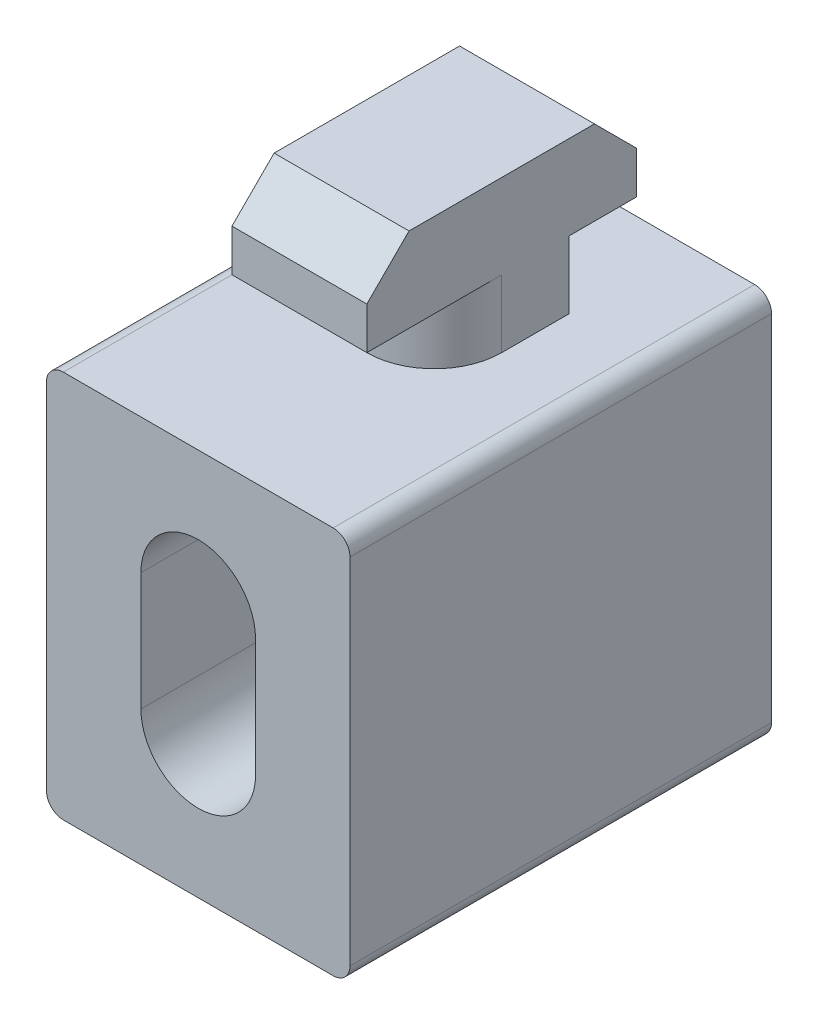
ISO-10303-21;
HEADER;
FILE_DESCRIPTION(('STEP AP214'),'2;1');
FILE_NAME('part.step','',(''),(''),'','','');
FILE_SCHEMA(('AUTOMOTIVE_DESIGN { 1 0 10303 214 1 1 1 1 }'));
ENDSEC;
DATA;
#1=APPLICATION_CONTEXT('core data for automotive mechanical design processes');
#2=APPLICATION_PROTOCOL_DEFINITION('international standard','automotive_design',2000,#1);
#3=PRODUCT_CONTEXT('',#1,'mechanical');
#4=PRODUCT('Part','Part','',(#3));
#5=PRODUCT_RELATED_PRODUCT_CATEGORY('part','',(#4));
#6=PRODUCT_DEFINITION_FORMATION('','',#4);
#7=PRODUCT_DEFINITION_CONTEXT('part definition',#1,'design');
#8=PRODUCT_DEFINITION('design','',#6,#7);
#9=PRODUCT_DEFINITION_SHAPE('','',#8);
#10=(LENGTH_UNIT() NAMED_UNIT(*) SI_UNIT(.MILLI.,.METRE.));
#11=(NAMED_UNIT(*) PLANE_ANGLE_UNIT() SI_UNIT($,.RADIAN.));
#12=(NAMED_UNIT(*) SI_UNIT($,.STERADIAN.) SOLID_ANGLE_UNIT());
#13=UNCERTAINTY_MEASURE_WITH_UNIT(LENGTH_MEASURE(1.E-05),#10,'distance_accuracy_value','');
#14=(GEOMETRIC_REPRESENTATION_CONTEXT(3) GLOBAL_UNCERTAINTY_ASSIGNED_CONTEXT((#13)) GLOBAL_UNIT_ASSIGNED_CONTEXT((#10,
#11,#12)) REPRESENTATION_CONTEXT('',''));
#15=CARTESIAN_POINT('',(0.,0.,0.));
#16=DIRECTION('',(0.,0.,1.));
#17=DIRECTION('',(1.,0.,0.));
#18=AXIS2_PLACEMENT_3D('',#15,#16,#17);
#19=CARTESIAN_POINT('',(-8.99999999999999,11.5,12.5));
#20=DIRECTION('',(0.,-1.,0.));
#21=DIRECTION('',(0.,0.,-1.));
#22=AXIS2_PLACEMENT_3D('',#19,#20,#21);
#23=PLANE('',#22);
#24=DIRECTION('',(-1.,0.,0.));
#25=VECTOR('',#24,1.);
#26=CARTESIAN_POINT('',(-8.99999999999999,11.5,12.5));
#27=LINE('',#26,#25);
#28=CARTESIAN_POINT('',(8.,11.5,12.5));
#29=VERTEX_POINT('',#28);
#30=CARTESIAN_POINT('',(-7.99999999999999,11.5,12.5));
#31=VERTEX_POINT('',#30);
#32=EDGE_CURVE('E565',#29,#31,#27,.T.);
#33=ORIENTED_EDGE('',*,*,#32,.F.);
#34=DIRECTION('',(0.,0.,-1.));
#35=VECTOR('',#34,1.);
#36=CARTESIAN_POINT('',(8.,11.5,12.5));
#37=LINE('',#36,#35);
#38=CARTESIAN_POINT('',(8.,11.5,-12.5));
#39=VERTEX_POINT('',#38);
#40=EDGE_CURVE('E11',#29,#39,#37,.T.);
#41=ORIENTED_EDGE('',*,*,#40,.T.);
#42=DIRECTION('',(-1.,0.,0.));
#43=VECTOR('',#42,1.);
#44=CARTESIAN_POINT('',(-8.99999999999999,11.5,-12.5));
#45=LINE('',#44,#43);
#46=CARTESIAN_POINT('',(-7.99999999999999,11.5,-12.5));
#47=VERTEX_POINT('',#46);
#48=EDGE_CURVE('E425',#39,#47,#45,.T.);
#49=ORIENTED_EDGE('',*,*,#48,.T.);
#50=DIRECTION('',(0.,0.,-1.));
#51=VECTOR('',#50,1.);
#52=CARTESIAN_POINT('',(-7.99999999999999,11.5,12.5));
#53=LINE('',#52,#51);
#54=EDGE_CURVE('E45',#47,#31,#53,.F.);
#55=ORIENTED_EDGE('',*,*,#54,.T.);
#56=EDGE_LOOP('',(#33,#41,#49,#55));
#57=FACE_BOUND('',#56,.T.);
#58=DIRECTION('',(1.,0.,0.));
#59=VECTOR('',#58,1.);
#60=CARTESIAN_POINT('',(-4.,11.5,2.5));
#61=LINE('',#60,#59);
#62=CARTESIAN_POINT('',(-4.,11.5,2.5));
#63=VERTEX_POINT('',#62);
#64=CARTESIAN_POINT('',(0.,11.5,2.5));
#65=VERTEX_POINT('',#64);
#66=EDGE_CURVE('E270',#63,#65,#61,.T.);
#67=ORIENTED_EDGE('',*,*,#66,.F.);
#68=DIRECTION('',(0.,0.,1.));
#69=VECTOR('',#68,1.);
#70=CARTESIAN_POINT('',(-4.,11.5,-1.5));
#71=LINE('',#70,#69);
#72=CARTESIAN_POINT('',(-4.,11.5,-1.5));
#73=VERTEX_POINT('',#72);
#74=EDGE_CURVE('E361',#73,#63,#71,.T.);
#75=ORIENTED_EDGE('',*,*,#74,.F.);
#76=CARTESIAN_POINT('',(0.,11.5,-1.5));
#77=DIRECTION('',(0.,1.,0.));
#78=DIRECTION('',(0.,0.,1.));
#79=AXIS2_PLACEMENT_3D('',#76,#77,#78);
#80=CIRCLE('',#79,4.);
#81=CARTESIAN_POINT('',(0.,11.5,-5.5));
#82=VERTEX_POINT('',#81);
#83=EDGE_CURVE('E468',#82,#73,#80,.T.);
#84=ORIENTED_EDGE('',*,*,#83,.F.);
#85=DIRECTION('',(-1.,0.,0.));
#86=VECTOR('',#85,1.);
#87=CARTESIAN_POINT('',(0.,11.5,-5.5));
#88=LINE('',#87,#86);
#89=CARTESIAN_POINT('',(4.,11.5,-5.5));
#90=VERTEX_POINT('',#89);
#91=EDGE_CURVE('E465',#90,#82,#88,.T.);
#92=ORIENTED_EDGE('',*,*,#91,.F.);
#93=DIRECTION('',(0.,0.,-1.));
#94=VECTOR('',#93,1.);
#95=CARTESIAN_POINT('',(4.,11.5,-5.5));
#96=LINE('',#95,#94);
#97=CARTESIAN_POINT('',(4.,11.5,-1.5));
#98=VERTEX_POINT('',#97);
#99=EDGE_CURVE('E337',#98,#90,#96,.T.);
#100=ORIENTED_EDGE('',*,*,#99,.F.);
#101=CARTESIAN_POINT('',(0.,11.5,-1.5));
#102=DIRECTION('',(0.,1.,0.));
#103=DIRECTION('',(0.,0.,1.));
#104=AXIS2_PLACEMENT_3D('',#101,#102,#103);
#105=CIRCLE('',#104,4.);
#106=EDGE_CURVE('E462',#65,#98,#105,.T.);
#107=ORIENTED_EDGE('',*,*,#106,.F.);
#108=EDGE_LOOP('',(#67,#75,#84,#92,#100,#107));
#109=FACE_BOUND('',#108,.T.);
#110=ADVANCED_FACE('F37',(#57,#109),#23,.F.);
#111=CARTESIAN_POINT('',(3.4,3.5,-12.5));
#112=DIRECTION('',(1.,0.,0.));
#113=DIRECTION('',(0.,1.,0.));
#114=AXIS2_PLACEMENT_3D('',#111,#112,#113);
#115=PLANE('',#114);
#116=DIRECTION('',(0.,0.,1.));
#117=VECTOR('',#116,1.);
#118=CARTESIAN_POINT('',(3.4,-3.5,-12.5));
#119=LINE('',#118,#117);
#120=CARTESIAN_POINT('',(3.4,-3.5,-12.5));
#121=VERTEX_POINT('',#120);
#122=CARTESIAN_POINT('',(3.4,-3.5,-3.5));
#123=VERTEX_POINT('',#122);
#124=EDGE_CURVE('E553',#121,#123,#119,.T.);
#125=ORIENTED_EDGE('',*,*,#124,.T.);
#126=DIRECTION('',(0.,1.,0.));
#127=VECTOR('',#126,1.);
#128=CARTESIAN_POINT('',(3.4,3.5,-3.5));
#129=LINE('',#128,#127);
#130=CARTESIAN_POINT('',(3.4,3.5,-3.5));
#131=VERTEX_POINT('',#130);
#132=EDGE_CURVE('E521',#123,#131,#129,.T.);
#133=ORIENTED_EDGE('',*,*,#132,.T.);
#134=DIRECTION('',(0.,0.,1.));
#135=VECTOR('',#134,1.);
#136=CARTESIAN_POINT('',(3.4,3.5,-12.5));
#137=LINE('',#136,#135);
#138=CARTESIAN_POINT('',(3.4,3.5,-12.5));
#139=VERTEX_POINT('',#138);
#140=EDGE_CURVE('E426',#139,#131,#137,.T.);
#141=ORIENTED_EDGE('',*,*,#140,.F.);
#142=DIRECTION('',(0.,1.,0.));
#143=VECTOR('',#142,1.);
#144=CARTESIAN_POINT('',(3.4,3.5,-12.5));
#145=LINE('',#144,#143);
#146=EDGE_CURVE('E538',#121,#139,#145,.T.);
#147=ORIENTED_EDGE('',*,*,#146,.F.);
#148=EDGE_LOOP('',(#125,#133,#141,#147));
#149=FACE_BOUND('',#148,.T.);
#150=ADVANCED_FACE('F598',(#149),#115,.F.);
#151=CARTESIAN_POINT('',(0.,-3.5,-12.5));
#152=DIRECTION('',(0.,0.,1.));
#153=DIRECTION('',(1.,0.,0.));
#154=AXIS2_PLACEMENT_3D('',#151,#152,#153);
#155=CYLINDRICAL_SURFACE('',#154,3.4);
#156=DIRECTION('',(0.,0.,1.));
#157=VECTOR('',#156,1.);
#158=CARTESIAN_POINT('',(-3.4,-3.5,-12.5));
#159=LINE('',#158,#157);
#160=CARTESIAN_POINT('',(-3.4,-3.5,-12.5));
#161=VERTEX_POINT('',#160);
#162=CARTESIAN_POINT('',(-3.4,-3.5,-3.5));
#163=VERTEX_POINT('',#162);
#164=EDGE_CURVE('E557',#161,#163,#159,.T.);
#165=ORIENTED_EDGE('',*,*,#164,.T.);
#166=CARTESIAN_POINT('',(0.,-3.5,-3.5));
#167=DIRECTION('',(0.,0.,-1.));
#168=DIRECTION('',(-1.,0.,0.));
#169=AXIS2_PLACEMENT_3D('',#166,#167,#168);
#170=CIRCLE('',#169,3.4);
#171=EDGE_CURVE('E518',#163,#123,#170,.F.);
#172=ORIENTED_EDGE('',*,*,#171,.T.);
#173=ORIENTED_EDGE('',*,*,#124,.F.);
#174=CARTESIAN_POINT('',(0.,-3.5,-12.5));
#175=DIRECTION('',(0.,0.,1.));
#176=DIRECTION('',(1.,0.,0.));
#177=AXIS2_PLACEMENT_3D('',#174,#175,#176);
#178=CIRCLE('',#177,3.4);
#179=EDGE_CURVE('E535',#161,#121,#178,.T.);
#180=ORIENTED_EDGE('',*,*,#179,.F.);
#181=EDGE_LOOP('',(#165,#172,#173,#180));
#182=FACE_BOUND('',#181,.T.);
#183=ADVANCED_FACE('F603',(#182),#155,.F.);
#184=CARTESIAN_POINT('',(-3.4,3.5,-12.5));
#185=DIRECTION('',(-1.,0.,0.));
#186=DIRECTION('',(0.,-1.,0.));
#187=AXIS2_PLACEMENT_3D('',#184,#185,#186);
#188=PLANE('',#187);
#189=DIRECTION('',(0.,0.,1.));
#190=VECTOR('',#189,1.);
#191=CARTESIAN_POINT('',(-3.4,3.5,-12.5));
#192=LINE('',#191,#190);
#193=CARTESIAN_POINT('',(-3.4,3.5,-12.5));
#194=VERTEX_POINT('',#193);
#195=CARTESIAN_POINT('',(-3.4,3.5,-3.5));
#196=VERTEX_POINT('',#195);
#197=EDGE_CURVE('E561',#194,#196,#192,.T.);
#198=ORIENTED_EDGE('',*,*,#197,.T.);
#199=DIRECTION('',(0.,-1.,0.));
#200=VECTOR('',#199,1.);
#201=CARTESIAN_POINT('',(-3.4,3.5,-3.5));
#202=LINE('',#201,#200);
#203=EDGE_CURVE('E444',#196,#163,#202,.T.);
#204=ORIENTED_EDGE('',*,*,#203,.T.);
#205=ORIENTED_EDGE('',*,*,#164,.F.);
#206=DIRECTION('',(0.,-1.,0.));
#207=VECTOR('',#206,1.);
#208=CARTESIAN_POINT('',(-3.4,3.5,-12.5));
#209=LINE('',#208,#207);
#210=EDGE_CURVE('E531',#194,#161,#209,.T.);
#211=ORIENTED_EDGE('',*,*,#210,.F.);
#212=EDGE_LOOP('',(#198,#204,#205,#211));
#213=FACE_BOUND('',#212,.T.);
#214=ADVANCED_FACE('F613',(#213),#188,.F.);
#215=CARTESIAN_POINT('',(9.00000000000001,11.5,12.5));
#216=DIRECTION('',(-1.,0.,0.));
#217=DIRECTION('',(0.,-1.,0.));
#218=AXIS2_PLACEMENT_3D('',#215,#216,#217);
#219=PLANE('',#218);
#220=DIRECTION('',(0.,1.,0.));
#221=VECTOR('',#220,1.);
#222=CARTESIAN_POINT('',(9.00000000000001,11.5,12.5));
#223=LINE('',#222,#221);
#224=CARTESIAN_POINT('',(9.00000000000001,-10.5,12.5));
#225=VERTEX_POINT('',#224);
#226=CARTESIAN_POINT('',(9.00000000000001,10.5,12.5));
#227=VERTEX_POINT('',#226);
#228=EDGE_CURVE('E417',#225,#227,#223,.T.);
#229=ORIENTED_EDGE('',*,*,#228,.F.);
#230=DIRECTION('',(0.,0.,-1.));
#231=VECTOR('',#230,1.);
#232=CARTESIAN_POINT('',(9.00000000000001,-10.5,12.5));
#233=LINE('',#232,#231);
#234=CARTESIAN_POINT('',(9.00000000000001,-10.5,-12.5));
#235=VERTEX_POINT('',#234);
#236=EDGE_CURVE('E407',#225,#235,#233,.T.);
#237=ORIENTED_EDGE('',*,*,#236,.T.);
#238=DIRECTION('',(0.,1.,0.));
#239=VECTOR('',#238,1.);
#240=CARTESIAN_POINT('',(9.00000000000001,11.5,-12.5));
#241=LINE('',#240,#239);
#242=CARTESIAN_POINT('',(9.00000000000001,10.5,-12.5));
#243=VERTEX_POINT('',#242);
#244=EDGE_CURVE('E415',#235,#243,#241,.T.);
#245=ORIENTED_EDGE('',*,*,#244,.T.);
#246=DIRECTION('',(0.,0.,-1.));
#247=VECTOR('',#246,1.);
#248=CARTESIAN_POINT('',(9.00000000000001,10.5,12.5));
#249=LINE('',#248,#247);
#250=EDGE_CURVE('E405',#243,#227,#249,.F.);
#251=ORIENTED_EDGE('',*,*,#250,.T.);
#252=EDGE_LOOP('',(#229,#237,#245,#251));
#253=FACE_BOUND('',#252,.T.);
#254=ADVANCED_FACE('F414',(#253),#219,.F.);
#255=CARTESIAN_POINT('',(-8.99999999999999,11.5,12.5));
#256=DIRECTION('',(1.,0.,0.));
#257=DIRECTION('',(0.,1.,0.));
#258=AXIS2_PLACEMENT_3D('',#255,#256,#257);
#259=PLANE('',#258);
#260=DIRECTION('',(0.,-1.,0.));
#261=VECTOR('',#260,1.);
#262=CARTESIAN_POINT('',(-8.99999999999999,11.5,-12.5));
#263=LINE('',#262,#261);
#264=CARTESIAN_POINT('',(-8.99999999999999,10.5,-12.5));
#265=VERTEX_POINT('',#264);
#266=CARTESIAN_POINT('',(-8.99999999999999,-10.5,-12.5));
#267=VERTEX_POINT('',#266);
#268=EDGE_CURVE('E428',#265,#267,#263,.T.);
#269=ORIENTED_EDGE('',*,*,#268,.T.);
#270=DIRECTION('',(0.,0.,-1.));
#271=VECTOR('',#270,1.);
#272=CARTESIAN_POINT('',(-8.99999999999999,-10.5,12.5));
#273=LINE('',#272,#271);
#274=CARTESIAN_POINT('',(-8.99999999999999,-10.5,12.5));
#275=VERTEX_POINT('',#274);
#276=EDGE_CURVE('E396',#267,#275,#273,.F.);
#277=ORIENTED_EDGE('',*,*,#276,.T.);
#278=DIRECTION('',(0.,-1.,0.));
#279=VECTOR('',#278,1.);
#280=CARTESIAN_POINT('',(-8.99999999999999,11.5,12.5));
#281=LINE('',#280,#279);
#282=CARTESIAN_POINT('',(-8.99999999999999,10.5,12.5));
#283=VERTEX_POINT('',#282);
#284=EDGE_CURVE('E566',#283,#275,#281,.T.);
#285=ORIENTED_EDGE('',*,*,#284,.F.);
#286=DIRECTION('',(0.,0.,-1.));
#287=VECTOR('',#286,1.);
#288=CARTESIAN_POINT('',(-8.99999999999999,10.5,12.5));
#289=LINE('',#288,#287);
#290=EDGE_CURVE('E393',#283,#265,#289,.T.);
#291=ORIENTED_EDGE('',*,*,#290,.T.);
#292=EDGE_LOOP('',(#269,#277,#285,#291));
#293=FACE_BOUND('',#292,.T.);
#294=ADVANCED_FACE('F582',(#293),#259,.F.);
#295=CARTESIAN_POINT('',(-8.99999999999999,-11.5,12.5));
#296=DIRECTION('',(0.,1.,0.));
#297=DIRECTION('',(0.,0.,1.));
#298=AXIS2_PLACEMENT_3D('',#295,#296,#297);
#299=PLANE('',#298);
#300=DIRECTION('',(-1.,0.,0.));
#301=VECTOR('',#300,1.);
#302=CARTESIAN_POINT('',(-5.,-11.5,1.5));
#303=LINE('',#302,#301);
#304=CARTESIAN_POINT('',(5.,-11.5,1.5));
#305=VERTEX_POINT('',#304);
#306=CARTESIAN_POINT('',(-5.,-11.5,1.5));
#307=VERTEX_POINT('',#306);
#308=EDGE_CURVE('E492',#305,#307,#303,.T.);
#309=ORIENTED_EDGE('',*,*,#308,.F.);
#310=DIRECTION('',(0.,0.,1.));
#311=VECTOR('',#310,1.);
#312=CARTESIAN_POINT('',(5.,-11.5,1.5));
#313=LINE('',#312,#311);
#314=CARTESIAN_POINT('',(5.,-11.5,-3.5));
#315=VERTEX_POINT('',#314);
#316=EDGE_CURVE('E343',#315,#305,#313,.T.);
#317=ORIENTED_EDGE('',*,*,#316,.F.);
#318=DIRECTION('',(1.,0.,0.));
#319=VECTOR('',#318,1.);
#320=CARTESIAN_POINT('',(-5.,-11.5,-3.5));
#321=LINE('',#320,#319);
#322=CARTESIAN_POINT('',(-5.,-11.5,-3.5));
#323=VERTEX_POINT('',#322);
#324=EDGE_CURVE('E479',#323,#315,#321,.T.);
#325=ORIENTED_EDGE('',*,*,#324,.F.);
#326=DIRECTION('',(0.,0.,-1.));
#327=VECTOR('',#326,1.);
#328=CARTESIAN_POINT('',(-5.,-11.5,1.5));
#329=LINE('',#328,#327);
#330=EDGE_CURVE('E495',#307,#323,#329,.T.);
#331=ORIENTED_EDGE('',*,*,#330,.F.);
#332=EDGE_LOOP('',(#309,#317,#325,#331));
#333=FACE_BOUND('',#332,.T.);
#334=DIRECTION('',(1.,0.,0.));
#335=VECTOR('',#334,1.);
#336=CARTESIAN_POINT('',(-8.99999999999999,-11.5,12.5));
#337=LINE('',#336,#335);
#338=CARTESIAN_POINT('',(-7.99999999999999,-11.5,12.5));
#339=VERTEX_POINT('',#338);
#340=CARTESIAN_POINT('',(8.00000000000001,-11.5,12.5));
#341=VERTEX_POINT('',#340);
#342=EDGE_CURVE('E434',#339,#341,#337,.T.);
#343=ORIENTED_EDGE('',*,*,#342,.F.);
#344=DIRECTION('',(0.,0.,-1.));
#345=VECTOR('',#344,1.);
#346=CARTESIAN_POINT('',(-7.99999999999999,-11.5,12.5));
#347=LINE('',#346,#345);
#348=CARTESIAN_POINT('',(-7.99999999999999,-11.5,-12.5));
#349=VERTEX_POINT('',#348);
#350=EDGE_CURVE('E382',#339,#349,#347,.T.);
#351=ORIENTED_EDGE('',*,*,#350,.T.);
#352=DIRECTION('',(1.,0.,0.));
#353=VECTOR('',#352,1.);
#354=CARTESIAN_POINT('',(-8.99999999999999,-11.5,-12.5));
#355=LINE('',#354,#353);
#356=CARTESIAN_POINT('',(8.00000000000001,-11.5,-12.5));
#357=VERTEX_POINT('',#356);
#358=EDGE_CURVE('E439',#349,#357,#355,.T.);
#359=ORIENTED_EDGE('',*,*,#358,.T.);
#360=DIRECTION('',(0.,0.,-1.));
#361=VECTOR('',#360,1.);
#362=CARTESIAN_POINT('',(8.00000000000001,-11.5,12.5));
#363=LINE('',#362,#361);
#364=EDGE_CURVE('E380',#357,#341,#363,.F.);
#365=ORIENTED_EDGE('',*,*,#364,.T.);
#366=EDGE_LOOP('',(#343,#351,#359,#365));
#367=FACE_BOUND('',#366,.T.);
#368=ADVANCED_FACE('F577',(#333,#367),#299,.F.);
#369=CARTESIAN_POINT('',(0.,0.,12.5));
#370=DIRECTION('',(0.,0.,1.));
#371=DIRECTION('',(1.,0.,0.));
#372=AXIS2_PLACEMENT_3D('',#369,#370,#371);
#373=PLANE('',#372);
#374=CARTESIAN_POINT('',(0.,3.5,12.5));
#375=DIRECTION('',(0.,0.,1.));
#376=DIRECTION('',(1.,0.,0.));
#377=AXIS2_PLACEMENT_3D('',#374,#375,#376);
#378=CIRCLE('',#377,3.4);
#379=CARTESIAN_POINT('',(3.4,3.5,12.5));
#380=VERTEX_POINT('',#379);
#381=CARTESIAN_POINT('',(-3.4,3.5,12.5));
#382=VERTEX_POINT('',#381);
#383=EDGE_CURVE('E542',#380,#382,#378,.T.);
#384=ORIENTED_EDGE('',*,*,#383,.F.);
#385=DIRECTION('',(0.,1.,0.));
#386=VECTOR('',#385,1.);
#387=CARTESIAN_POINT('',(3.4,3.5,12.5));
#388=LINE('',#387,#386);
#389=CARTESIAN_POINT('',(3.4,-3.5,12.5));
#390=VERTEX_POINT('',#389);
#391=EDGE_CURVE('E532',#390,#380,#388,.T.);
#392=ORIENTED_EDGE('',*,*,#391,.F.);
#393=CARTESIAN_POINT('',(0.,-3.5,12.5));
#394=DIRECTION('',(0.,0.,1.));
#395=DIRECTION('',(1.,0.,0.));
#396=AXIS2_PLACEMENT_3D('',#393,#394,#395);
#397=CIRCLE('',#396,3.4);
#398=CARTESIAN_POINT('',(-3.4,-3.5,12.5));
#399=VERTEX_POINT('',#398);
#400=EDGE_CURVE('E548',#399,#390,#397,.T.);
#401=ORIENTED_EDGE('',*,*,#400,.F.);
#402=DIRECTION('',(0.,-1.,0.));
#403=VECTOR('',#402,1.);
#404=CARTESIAN_POINT('',(-3.4,3.5,12.5));
#405=LINE('',#404,#403);
#406=EDGE_CURVE('E545',#382,#399,#405,.T.);
#407=ORIENTED_EDGE('',*,*,#406,.F.);
#408=EDGE_LOOP('',(#384,#392,#401,#407));
#409=FACE_BOUND('',#408,.T.);
#410=ORIENTED_EDGE('',*,*,#284,.T.);
#411=CARTESIAN_POINT('',(-7.99999999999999,-10.5,12.5));
#412=DIRECTION('',(0.,0.,1.));
#413=DIRECTION('',(1.,0.,0.));
#414=AXIS2_PLACEMENT_3D('',#411,#412,#413);
#415=CIRCLE('',#414,1.);
#416=EDGE_CURVE('E403',#275,#339,#415,.T.);
#417=ORIENTED_EDGE('',*,*,#416,.T.);
#418=ORIENTED_EDGE('',*,*,#342,.T.);
#419=CARTESIAN_POINT('',(8.00000000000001,-10.5,12.5));
#420=DIRECTION('',(0.,0.,1.));
#421=DIRECTION('',(1.,0.,0.));
#422=AXIS2_PLACEMENT_3D('',#419,#420,#421);
#423=CIRCLE('',#422,1.);
#424=EDGE_CURVE('E401',#341,#225,#423,.T.);
#425=ORIENTED_EDGE('',*,*,#424,.T.);
#426=ORIENTED_EDGE('',*,*,#228,.T.);
#427=CARTESIAN_POINT('',(8.,10.5,12.5));
#428=DIRECTION('',(0.,0.,1.));
#429=DIRECTION('',(1.,0.,0.));
#430=AXIS2_PLACEMENT_3D('',#427,#428,#429);
#431=CIRCLE('',#430,1.);
#432=EDGE_CURVE('E58',#227,#29,#431,.T.);
#433=ORIENTED_EDGE('',*,*,#432,.T.);
#434=ORIENTED_EDGE('',*,*,#32,.T.);
#435=CARTESIAN_POINT('',(-7.99999999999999,10.5,12.5));
#436=DIRECTION('',(0.,0.,1.));
#437=DIRECTION('',(1.,0.,0.));
#438=AXIS2_PLACEMENT_3D('',#435,#436,#437);
#439=CIRCLE('',#438,1.);
#440=EDGE_CURVE('E398',#31,#283,#439,.T.);
#441=ORIENTED_EDGE('',*,*,#440,.T.);
#442=EDGE_LOOP('',(#410,#417,#418,#425,#426,#433,#434,#441));
#443=FACE_BOUND('',#442,.T.);
#444=ADVANCED_FACE('F572',(#409,#443),#373,.T.);
#445=CARTESIAN_POINT('',(0.,0.,-12.5));
#446=DIRECTION('',(0.,0.,1.));
#447=DIRECTION('',(1.,0.,0.));
#448=AXIS2_PLACEMENT_3D('',#445,#446,#447);
#449=PLANE('',#448);
#450=ORIENTED_EDGE('',*,*,#146,.T.);
#451=CARTESIAN_POINT('',(0.,3.5,-12.5));
#452=DIRECTION('',(0.,0.,1.));
#453=DIRECTION('',(1.,0.,0.));
#454=AXIS2_PLACEMENT_3D('',#451,#452,#453);
#455=CIRCLE('',#454,3.4);
#456=EDGE_CURVE('E528',#139,#194,#455,.T.);
#457=ORIENTED_EDGE('',*,*,#456,.T.);
#458=ORIENTED_EDGE('',*,*,#210,.T.);
#459=ORIENTED_EDGE('',*,*,#179,.T.);
#460=EDGE_LOOP('',(#450,#457,#458,#459));
#461=FACE_BOUND('',#460,.T.);
#462=ORIENTED_EDGE('',*,*,#358,.F.);
#463=CARTESIAN_POINT('',(-7.99999999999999,-10.5,-12.5));
#464=DIRECTION('',(0.,0.,1.));
#465=DIRECTION('',(1.,0.,0.));
#466=AXIS2_PLACEMENT_3D('',#463,#464,#465);
#467=CIRCLE('',#466,1.);
#468=EDGE_CURVE('E391',#349,#267,#467,.F.);
#469=ORIENTED_EDGE('',*,*,#468,.T.);
#470=ORIENTED_EDGE('',*,*,#268,.F.);
#471=CARTESIAN_POINT('',(-7.99999999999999,10.5,-12.5));
#472=DIRECTION('',(0.,0.,1.));
#473=DIRECTION('',(1.,0.,0.));
#474=AXIS2_PLACEMENT_3D('',#471,#472,#473);
#475=CIRCLE('',#474,1.);
#476=EDGE_CURVE('E385',#265,#47,#475,.F.);
#477=ORIENTED_EDGE('',*,*,#476,.T.);
#478=ORIENTED_EDGE('',*,*,#48,.F.);
#479=CARTESIAN_POINT('',(8.,10.5,-12.5));
#480=DIRECTION('',(0.,0.,1.));
#481=DIRECTION('',(1.,0.,0.));
#482=AXIS2_PLACEMENT_3D('',#479,#480,#481);
#483=CIRCLE('',#482,1.);
#484=EDGE_CURVE('E387',#39,#243,#483,.F.);
#485=ORIENTED_EDGE('',*,*,#484,.T.);
#486=ORIENTED_EDGE('',*,*,#244,.F.);
#487=CARTESIAN_POINT('',(8.00000000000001,-10.5,-12.5));
#488=DIRECTION('',(0.,0.,1.));
#489=DIRECTION('',(1.,0.,0.));
#490=AXIS2_PLACEMENT_3D('',#487,#488,#489);
#491=CIRCLE('',#490,1.);
#492=EDGE_CURVE('E389',#235,#357,#491,.F.);
#493=ORIENTED_EDGE('',*,*,#492,.T.);
#494=EDGE_LOOP('',(#462,#469,#470,#477,#478,#485,#486,#493));
#495=FACE_BOUND('',#494,.T.);
#496=ADVANCED_FACE('F422',(#461,#495),#449,.F.);
#497=CARTESIAN_POINT('',(0.,3.5,-12.5));
#498=DIRECTION('',(0.,0.,1.));
#499=DIRECTION('',(1.,0.,0.));
#500=AXIS2_PLACEMENT_3D('',#497,#498,#499);
#501=CYLINDRICAL_SURFACE('',#500,3.4);
#502=ORIENTED_EDGE('',*,*,#140,.T.);
#503=CARTESIAN_POINT('',(0.,3.5,-3.5));
#504=DIRECTION('',(0.,0.,-1.));
#505=DIRECTION('',(-1.,0.,0.));
#506=AXIS2_PLACEMENT_3D('',#503,#504,#505);
#507=CIRCLE('',#506,3.4);
#508=CARTESIAN_POINT('',(1.59999999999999,6.5,-3.5));
#509=VERTEX_POINT('',#508);
#510=EDGE_CURVE('E524',#131,#509,#507,.F.);
#511=ORIENTED_EDGE('',*,*,#510,.T.);
#512=DIRECTION('',(0.,0.,1.));
#513=VECTOR('',#512,1.);
#514=CARTESIAN_POINT('',(1.59999999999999,6.5,-12.5));
#515=LINE('',#514,#513);
#516=CARTESIAN_POINT('',(1.59999999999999,6.5,1.5));
#517=VERTEX_POINT('',#516);
#518=EDGE_CURVE('E367',#517,#509,#515,.F.);
#519=ORIENTED_EDGE('',*,*,#518,.F.);
#520=CARTESIAN_POINT('',(0.,3.5,1.5));
#521=DIRECTION('',(0.,0.,1.));
#522=DIRECTION('',(1.,0.,0.));
#523=AXIS2_PLACEMENT_3D('',#520,#521,#522);
#524=CIRCLE('',#523,3.4);
#525=CARTESIAN_POINT('',(3.4,3.5,1.5));
#526=VERTEX_POINT('',#525);
#527=EDGE_CURVE('E517',#517,#526,#524,.F.);
#528=ORIENTED_EDGE('',*,*,#527,.T.);
#529=EDGE_CURVE('E431',#526,#380,#137,.T.);
#530=ORIENTED_EDGE('',*,*,#529,.T.);
#531=ORIENTED_EDGE('',*,*,#383,.T.);
#532=CARTESIAN_POINT('',(-3.4,3.5,1.5));
#533=VERTEX_POINT('',#532);
#534=EDGE_CURVE('E541',#533,#382,#192,.T.);
#535=ORIENTED_EDGE('',*,*,#534,.F.);
#536=CARTESIAN_POINT('',(-1.59999999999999,6.5,1.5));
#537=VERTEX_POINT('',#536);
#538=EDGE_CURVE('E514',#533,#537,#524,.F.);
#539=ORIENTED_EDGE('',*,*,#538,.T.);
#540=DIRECTION('',(0.,0.,1.));
#541=VECTOR('',#540,1.);
#542=CARTESIAN_POINT('',(-1.59999999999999,6.5,-12.5));
#543=LINE('',#542,#541);
#544=CARTESIAN_POINT('',(-1.59999999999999,6.5,-3.5));
#545=VERTEX_POINT('',#544);
#546=EDGE_CURVE('E447',#545,#537,#543,.T.);
#547=ORIENTED_EDGE('',*,*,#546,.F.);
#548=EDGE_CURVE('E527',#545,#196,#507,.F.);
#549=ORIENTED_EDGE('',*,*,#548,.T.);
#550=ORIENTED_EDGE('',*,*,#197,.F.);
#551=ORIENTED_EDGE('',*,*,#456,.F.);
#552=EDGE_LOOP('',(#502,#511,#519,#528,#530,#531,#535,#539,#547,#549,#550,#551));
#553=FACE_BOUND('',#552,.T.);
#554=ADVANCED_FACE('F677',(#553),#501,.F.);
#555=ORIENTED_EDGE('',*,*,#529,.F.);
#556=DIRECTION('',(0.,-1.,0.));
#557=VECTOR('',#556,1.);
#558=CARTESIAN_POINT('',(3.4,3.5,1.5));
#559=LINE('',#558,#557);
#560=CARTESIAN_POINT('',(3.4,-3.5,1.5));
#561=VERTEX_POINT('',#560);
#562=EDGE_CURVE('E511',#526,#561,#559,.T.);
#563=ORIENTED_EDGE('',*,*,#562,.T.);
#564=EDGE_CURVE('E556',#561,#390,#119,.T.);
#565=ORIENTED_EDGE('',*,*,#564,.T.);
#566=ORIENTED_EDGE('',*,*,#391,.T.);
#567=EDGE_LOOP('',(#555,#563,#565,#566));
#568=FACE_BOUND('',#567,.T.);
#569=ADVANCED_FACE('F606',(#568),#115,.F.);
#570=ORIENTED_EDGE('',*,*,#564,.F.);
#571=CARTESIAN_POINT('',(0.,-3.5,1.5));
#572=DIRECTION('',(0.,0.,1.));
#573=DIRECTION('',(1.,0.,0.));
#574=AXIS2_PLACEMENT_3D('',#571,#572,#573);
#575=CIRCLE('',#574,3.4);
#576=CARTESIAN_POINT('',(-3.4,-3.5,1.5));
#577=VERTEX_POINT('',#576);
#578=EDGE_CURVE('E502',#561,#577,#575,.F.);
#579=ORIENTED_EDGE('',*,*,#578,.T.);
#580=EDGE_CURVE('E560',#577,#399,#159,.T.);
#581=ORIENTED_EDGE('',*,*,#580,.T.);
#582=ORIENTED_EDGE('',*,*,#400,.T.);
#583=EDGE_LOOP('',(#570,#579,#581,#582));
#584=FACE_BOUND('',#583,.T.);
#585=ADVANCED_FACE('F676',(#584),#155,.F.);
#586=ORIENTED_EDGE('',*,*,#580,.F.);
#587=DIRECTION('',(0.,1.,0.));
#588=VECTOR('',#587,1.);
#589=CARTESIAN_POINT('',(-3.4,3.5,1.5));
#590=LINE('',#589,#588);
#591=EDGE_CURVE('E441',#577,#533,#590,.T.);
#592=ORIENTED_EDGE('',*,*,#591,.T.);
#593=ORIENTED_EDGE('',*,*,#534,.T.);
#594=ORIENTED_EDGE('',*,*,#406,.T.);
#595=EDGE_LOOP('',(#586,#592,#593,#594));
#596=FACE_BOUND('',#595,.T.);
#597=ADVANCED_FACE('F658',(#596),#188,.F.);
#598=CARTESIAN_POINT('',(0.,6.5,0.));
#599=DIRECTION('',(0.,-1.,0.));
#600=DIRECTION('',(0.,0.,-1.));
#601=AXIS2_PLACEMENT_3D('',#598,#599,#600);
#602=PLANE('',#601);
#603=ORIENTED_EDGE('',*,*,#518,.T.);
#604=DIRECTION('',(1.,0.,0.));
#605=VECTOR('',#604,1.);
#606=CARTESIAN_POINT('',(-5.,6.5,-3.5));
#607=LINE('',#606,#605);
#608=CARTESIAN_POINT('',(5.,6.5,-3.5));
#609=VERTEX_POINT('',#608);
#610=EDGE_CURVE('E486',#509,#609,#607,.T.);
#611=ORIENTED_EDGE('',*,*,#610,.T.);
#612=DIRECTION('',(0.,0.,1.));
#613=VECTOR('',#612,1.);
#614=CARTESIAN_POINT('',(5.,6.5,1.5));
#615=LINE('',#614,#613);
#616=CARTESIAN_POINT('',(5.,6.5,1.5));
#617=VERTEX_POINT('',#616);
#618=EDGE_CURVE('E475',#609,#617,#615,.T.);
#619=ORIENTED_EDGE('',*,*,#618,.T.);
#620=DIRECTION('',(-1.,0.,0.));
#621=VECTOR('',#620,1.);
#622=CARTESIAN_POINT('',(-5.,6.5,1.5));
#623=LINE('',#622,#621);
#624=EDGE_CURVE('E480',#617,#517,#623,.T.);
#625=ORIENTED_EDGE('',*,*,#624,.T.);
#626=EDGE_LOOP('',(#603,#611,#619,#625));
#627=FACE_BOUND('',#626,.T.);
#628=ADVANCED_FACE('F654',(#627),#602,.T.);
#629=ORIENTED_EDGE('',*,*,#546,.T.);
#630=CARTESIAN_POINT('',(-5.,6.5,1.5));
#631=VERTEX_POINT('',#630);
#632=EDGE_CURVE('E478',#537,#631,#623,.T.);
#633=ORIENTED_EDGE('',*,*,#632,.T.);
#634=DIRECTION('',(0.,0.,-1.));
#635=VECTOR('',#634,1.);
#636=CARTESIAN_POINT('',(-5.,6.5,1.5));
#637=LINE('',#636,#635);
#638=CARTESIAN_POINT('',(-5.,6.5,-3.5));
#639=VERTEX_POINT('',#638);
#640=EDGE_CURVE('E483',#631,#639,#637,.T.);
#641=ORIENTED_EDGE('',*,*,#640,.T.);
#642=EDGE_CURVE('E487',#639,#545,#607,.T.);
#643=ORIENTED_EDGE('',*,*,#642,.T.);
#644=EDGE_LOOP('',(#629,#633,#641,#643));
#645=FACE_BOUND('',#644,.T.);
#646=ADVANCED_FACE('F657',(#645),#602,.T.);
#647=CARTESIAN_POINT('',(-5.,6.5,-3.5));
#648=DIRECTION('',(0.,0.,-1.));
#649=DIRECTION('',(-1.,0.,0.));
#650=AXIS2_PLACEMENT_3D('',#647,#648,#649);
#651=PLANE('',#650);
#652=ORIENTED_EDGE('',*,*,#642,.F.);
#653=DIRECTION('',(0.,-1.,0.));
#654=VECTOR('',#653,1.);
#655=CARTESIAN_POINT('',(-5.,6.5,-3.5));
#656=LINE('',#655,#654);
#657=EDGE_CURVE('E503',#639,#323,#656,.T.);
#658=ORIENTED_EDGE('',*,*,#657,.T.);
#659=ORIENTED_EDGE('',*,*,#324,.T.);
#660=DIRECTION('',(0.,-1.,0.));
#661=VECTOR('',#660,1.);
#662=CARTESIAN_POINT('',(5.,6.5,-3.5));
#663=LINE('',#662,#661);
#664=EDGE_CURVE('E500',#609,#315,#663,.T.);
#665=ORIENTED_EDGE('',*,*,#664,.F.);
#666=ORIENTED_EDGE('',*,*,#610,.F.);
#667=ORIENTED_EDGE('',*,*,#510,.F.);
#668=ORIENTED_EDGE('',*,*,#132,.F.);
#669=ORIENTED_EDGE('',*,*,#171,.F.);
#670=ORIENTED_EDGE('',*,*,#203,.F.);
#671=ORIENTED_EDGE('',*,*,#548,.F.);
#672=EDGE_LOOP('',(#652,#658,#659,#665,#666,#667,#668,#669,#670,#671));
#673=FACE_BOUND('',#672,.T.);
#674=ADVANCED_FACE('F660',(#673),#651,.F.);
#675=CARTESIAN_POINT('',(-5.,6.5,1.5));
#676=DIRECTION('',(0.,0.,1.));
#677=DIRECTION('',(1.,0.,0.));
#678=AXIS2_PLACEMENT_3D('',#675,#676,#677);
#679=PLANE('',#678);
#680=ORIENTED_EDGE('',*,*,#624,.F.);
#681=DIRECTION('',(0.,-1.,0.));
#682=VECTOR('',#681,1.);
#683=CARTESIAN_POINT('',(5.,6.5,1.5));
#684=LINE('',#683,#682);
#685=EDGE_CURVE('E490',#617,#305,#684,.T.);
#686=ORIENTED_EDGE('',*,*,#685,.T.);
#687=ORIENTED_EDGE('',*,*,#308,.T.);
#688=DIRECTION('',(0.,-1.,0.));
#689=VECTOR('',#688,1.);
#690=CARTESIAN_POINT('',(-5.,6.5,1.5));
#691=LINE('',#690,#689);
#692=EDGE_CURVE('E505',#631,#307,#691,.T.);
#693=ORIENTED_EDGE('',*,*,#692,.F.);
#694=ORIENTED_EDGE('',*,*,#632,.F.);
#695=ORIENTED_EDGE('',*,*,#538,.F.);
#696=ORIENTED_EDGE('',*,*,#591,.F.);
#697=ORIENTED_EDGE('',*,*,#578,.F.);
#698=ORIENTED_EDGE('',*,*,#562,.F.);
#699=ORIENTED_EDGE('',*,*,#527,.F.);
#700=EDGE_LOOP('',(#680,#686,#687,#693,#694,#695,#696,#697,#698,#699));
#701=FACE_BOUND('',#700,.T.);
#702=ADVANCED_FACE('F663',(#701),#679,.F.);
#703=CARTESIAN_POINT('',(5.,6.5,1.5));
#704=DIRECTION('',(1.,0.,0.));
#705=DIRECTION('',(0.,0.,-1.));
#706=AXIS2_PLACEMENT_3D('',#703,#704,#705);
#707=PLANE('',#706);
#708=ORIENTED_EDGE('',*,*,#316,.T.);
#709=ORIENTED_EDGE('',*,*,#685,.F.);
#710=ORIENTED_EDGE('',*,*,#618,.F.);
#711=ORIENTED_EDGE('',*,*,#664,.T.);
#712=EDGE_LOOP('',(#708,#709,#710,#711));
#713=FACE_BOUND('',#712,.T.);
#714=ADVANCED_FACE('F667',(#713),#707,.F.);
#715=CARTESIAN_POINT('',(-5.,6.5,1.5));
#716=DIRECTION('',(-1.,0.,0.));
#717=DIRECTION('',(0.,0.,1.));
#718=AXIS2_PLACEMENT_3D('',#715,#716,#717);
#719=PLANE('',#718);
#720=ORIENTED_EDGE('',*,*,#330,.T.);
#721=ORIENTED_EDGE('',*,*,#657,.F.);
#722=ORIENTED_EDGE('',*,*,#640,.F.);
#723=ORIENTED_EDGE('',*,*,#692,.T.);
#724=EDGE_LOOP('',(#720,#721,#722,#723));
#725=FACE_BOUND('',#724,.T.);
#726=ADVANCED_FACE('F653',(#725),#719,.F.);
#727=CARTESIAN_POINT('',(-4.,15.5,2.5));
#728=DIRECTION('',(0.,0.,-1.));
#729=DIRECTION('',(-1.,0.,0.));
#730=AXIS2_PLACEMENT_3D('',#727,#728,#729);
#731=PLANE('',#730);
#732=ORIENTED_EDGE('',*,*,#66,.T.);
#733=DIRECTION('',(0.,-1.,0.));
#734=VECTOR('',#733,1.);
#735=CARTESIAN_POINT('',(0.,15.5,2.5));
#736=LINE('',#735,#734);
#737=CARTESIAN_POINT('',(0.,15.5,2.5));
#738=VERTEX_POINT('',#737);
#739=EDGE_CURVE('E340',#738,#65,#736,.T.);
#740=ORIENTED_EDGE('',*,*,#739,.F.);
#741=DIRECTION('',(1.,0.,0.));
#742=VECTOR('',#741,1.);
#743=CARTESIAN_POINT('',(-4.,15.5,2.5));
#744=LINE('',#743,#742);
#745=CARTESIAN_POINT('',(-4.,15.5,2.5));
#746=VERTEX_POINT('',#745);
#747=EDGE_CURVE('E359',#746,#738,#744,.T.);
#748=ORIENTED_EDGE('',*,*,#747,.F.);
#749=DIRECTION('',(0.,-1.,0.));
#750=VECTOR('',#749,1.);
#751=CARTESIAN_POINT('',(-4.,15.5,2.5));
#752=LINE('',#751,#750);
#753=EDGE_CURVE('E352',#746,#63,#752,.T.);
#754=ORIENTED_EDGE('',*,*,#753,.T.);
#755=EDGE_LOOP('',(#732,#740,#748,#754));
#756=FACE_BOUND('',#755,.T.);
#757=ADVANCED_FACE('F627',(#756),#731,.F.);
#758=CARTESIAN_POINT('',(0.,15.5,-1.5));
#759=DIRECTION('',(0.,-1.,0.));
#760=DIRECTION('',(0.,0.,-1.));
#761=AXIS2_PLACEMENT_3D('',#758,#759,#760);
#762=CYLINDRICAL_SURFACE('',#761,4.);
#763=ORIENTED_EDGE('',*,*,#106,.T.);
#764=DIRECTION('',(0.,-1.,0.));
#765=VECTOR('',#764,1.);
#766=CARTESIAN_POINT('',(4.,15.5,-1.5));
#767=LINE('',#766,#765);
#768=CARTESIAN_POINT('',(4.,15.5,-1.5));
#769=VERTEX_POINT('',#768);
#770=EDGE_CURVE('E336',#769,#98,#767,.T.);
#771=ORIENTED_EDGE('',*,*,#770,.F.);
#772=CARTESIAN_POINT('',(0.,15.5,-1.5));
#773=DIRECTION('',(0.,1.,0.));
#774=DIRECTION('',(0.,0.,1.));
#775=AXIS2_PLACEMENT_3D('',#772,#773,#774);
#776=CIRCLE('',#775,4.);
#777=EDGE_CURVE('E334',#738,#769,#776,.T.);
#778=ORIENTED_EDGE('',*,*,#777,.F.);
#779=ORIENTED_EDGE('',*,*,#739,.T.);
#780=EDGE_LOOP('',(#763,#771,#778,#779));
#781=FACE_BOUND('',#780,.T.);
#782=ADVANCED_FACE('F628',(#781),#762,.T.);
#783=CARTESIAN_POINT('',(4.,15.5,-5.5));
#784=DIRECTION('',(-1.,0.,0.));
#785=DIRECTION('',(0.,0.,1.));
#786=AXIS2_PLACEMENT_3D('',#783,#784,#785);
#787=PLANE('',#786);
#788=DIRECTION('',(0.,-1.,0.));
#789=VECTOR('',#788,1.);
#790=CARTESIAN_POINT('',(3.99999999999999,20.5,-9.5));
#791=LINE('',#790,#789);
#792=CARTESIAN_POINT('',(3.99999999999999,18.,-9.5));
#793=VERTEX_POINT('',#792);
#794=CARTESIAN_POINT('',(3.99999999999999,15.5,-9.5));
#795=VERTEX_POINT('',#794);
#796=EDGE_CURVE('E259',#793,#795,#791,.T.);
#797=ORIENTED_EDGE('',*,*,#796,.F.);
#798=DIRECTION('',(0.,0.707106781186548,0.707106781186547));
#799=VECTOR('',#798,1.);
#800=CARTESIAN_POINT('',(4.,20.5,-7.00000000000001));
#801=LINE('',#800,#799);
#802=CARTESIAN_POINT('',(3.99999999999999,20.5,-7.00000000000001));
#803=VERTEX_POINT('',#802);
#804=EDGE_CURVE('E376',#793,#803,#801,.T.);
#805=ORIENTED_EDGE('',*,*,#804,.T.);
#806=DIRECTION('',(0.,0.,-1.));
#807=VECTOR('',#806,1.);
#808=CARTESIAN_POINT('',(3.99999999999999,20.5,-9.5));
#809=LINE('',#808,#807);
#810=CARTESIAN_POINT('',(3.99999999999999,20.5,4.00000000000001));
#811=VERTEX_POINT('',#810);
#812=EDGE_CURVE('E313',#811,#803,#809,.T.);
#813=ORIENTED_EDGE('',*,*,#812,.F.);
#814=DIRECTION('',(0.,-0.707106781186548,0.707106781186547));
#815=VECTOR('',#814,1.);
#816=CARTESIAN_POINT('',(4.,20.5,4.00000000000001));
#817=LINE('',#816,#815);
#818=CARTESIAN_POINT('',(3.99999999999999,18.,6.5));
#819=VERTEX_POINT('',#818);
#820=EDGE_CURVE('E374',#811,#819,#817,.T.);
#821=ORIENTED_EDGE('',*,*,#820,.T.);
#822=DIRECTION('',(0.,-1.,0.));
#823=VECTOR('',#822,1.);
#824=CARTESIAN_POINT('',(3.99999999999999,20.5,6.5));
#825=LINE('',#824,#823);
#826=CARTESIAN_POINT('',(3.99999999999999,15.5,6.5));
#827=VERTEX_POINT('',#826);
#828=EDGE_CURVE('E308',#819,#827,#825,.T.);
#829=ORIENTED_EDGE('',*,*,#828,.T.);
#830=DIRECTION('',(0.,0.,-1.));
#831=VECTOR('',#830,1.);
#832=CARTESIAN_POINT('',(3.99999999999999,15.5,-9.5));
#833=LINE('',#832,#831);
#834=EDGE_CURVE('E282',#827,#769,#833,.T.);
#835=ORIENTED_EDGE('',*,*,#834,.T.);
#836=ORIENTED_EDGE('',*,*,#770,.T.);
#837=ORIENTED_EDGE('',*,*,#99,.T.);
#838=DIRECTION('',(0.,-1.,0.));
#839=VECTOR('',#838,1.);
#840=CARTESIAN_POINT('',(4.,15.5,-5.5));
#841=LINE('',#840,#839);
#842=CARTESIAN_POINT('',(4.,15.5,-5.5));
#843=VERTEX_POINT('',#842);
#844=EDGE_CURVE('E278',#843,#90,#841,.T.);
#845=ORIENTED_EDGE('',*,*,#844,.F.);
#846=EDGE_CURVE('E274',#843,#795,#833,.T.);
#847=ORIENTED_EDGE('',*,*,#846,.T.);
#848=EDGE_LOOP('',(#797,#805,#813,#821,#829,#835,#836,#837,#845,#847));
#849=FACE_BOUND('',#848,.T.);
#850=ADVANCED_FACE('F275',(#849),#787,.F.);
#851=CARTESIAN_POINT('',(0.,15.5,-5.5));
#852=DIRECTION('',(0.,0.,1.));
#853=DIRECTION('',(1.,0.,0.));
#854=AXIS2_PLACEMENT_3D('',#851,#852,#853);
#855=PLANE('',#854);
#856=ORIENTED_EDGE('',*,*,#91,.T.);
#857=DIRECTION('',(0.,-1.,0.));
#858=VECTOR('',#857,1.);
#859=CARTESIAN_POINT('',(0.,15.5,-5.5));
#860=LINE('',#859,#858);
#861=CARTESIAN_POINT('',(0.,15.5,-5.5));
#862=VERTEX_POINT('',#861);
#863=EDGE_CURVE('E345',#862,#82,#860,.T.);
#864=ORIENTED_EDGE('',*,*,#863,.F.);
#865=DIRECTION('',(-1.,0.,0.));
#866=VECTOR('',#865,1.);
#867=CARTESIAN_POINT('',(0.,15.5,-5.5));
#868=LINE('',#867,#866);
#869=EDGE_CURVE('E455',#843,#862,#868,.T.);
#870=ORIENTED_EDGE('',*,*,#869,.F.);
#871=ORIENTED_EDGE('',*,*,#844,.T.);
#872=EDGE_LOOP('',(#856,#864,#870,#871));
#873=FACE_BOUND('',#872,.T.);
#874=ADVANCED_FACE('F634',(#873),#855,.F.);
#875=CARTESIAN_POINT('',(0.,15.5,-1.5));
#876=DIRECTION('',(0.,-1.,0.));
#877=DIRECTION('',(0.,0.,-1.));
#878=AXIS2_PLACEMENT_3D('',#875,#876,#877);
#879=CYLINDRICAL_SURFACE('',#878,4.);
#880=ORIENTED_EDGE('',*,*,#83,.T.);
#881=DIRECTION('',(0.,-1.,0.));
#882=VECTOR('',#881,1.);
#883=CARTESIAN_POINT('',(-4.,15.5,-1.5));
#884=LINE('',#883,#882);
#885=CARTESIAN_POINT('',(-4.,15.5,-1.5));
#886=VERTEX_POINT('',#885);
#887=EDGE_CURVE('E355',#886,#73,#884,.T.);
#888=ORIENTED_EDGE('',*,*,#887,.F.);
#889=CARTESIAN_POINT('',(0.,15.5,-1.5));
#890=DIRECTION('',(0.,1.,0.));
#891=DIRECTION('',(0.,0.,1.));
#892=AXIS2_PLACEMENT_3D('',#889,#890,#891);
#893=CIRCLE('',#892,4.);
#894=EDGE_CURVE('E356',#862,#886,#893,.T.);
#895=ORIENTED_EDGE('',*,*,#894,.F.);
#896=ORIENTED_EDGE('',*,*,#863,.T.);
#897=EDGE_LOOP('',(#880,#888,#895,#896));
#898=FACE_BOUND('',#897,.T.);
#899=ADVANCED_FACE('F636',(#898),#879,.T.);
#900=CARTESIAN_POINT('',(-4.,15.5,-1.5));
#901=DIRECTION('',(1.,0.,0.));
#902=DIRECTION('',(0.,0.,-1.));
#903=AXIS2_PLACEMENT_3D('',#900,#901,#902);
#904=PLANE('',#903);
#905=DIRECTION('',(0.,0.,1.));
#906=VECTOR('',#905,1.);
#907=CARTESIAN_POINT('',(-4.,20.5,-9.5));
#908=LINE('',#907,#906);
#909=CARTESIAN_POINT('',(-4.,20.5,-7.00000000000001));
#910=VERTEX_POINT('',#909);
#911=CARTESIAN_POINT('',(-4.,20.5,4.00000000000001));
#912=VERTEX_POINT('',#911);
#913=EDGE_CURVE('E309',#910,#912,#908,.T.);
#914=ORIENTED_EDGE('',*,*,#913,.F.);
#915=DIRECTION('',(0.,-0.707106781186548,-0.707106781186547));
#916=VECTOR('',#915,1.);
#917=CARTESIAN_POINT('',(-4.,20.5,-7.00000000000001));
#918=LINE('',#917,#916);
#919=CARTESIAN_POINT('',(-4.,18.,-9.5));
#920=VERTEX_POINT('',#919);
#921=EDGE_CURVE('E371',#910,#920,#918,.T.);
#922=ORIENTED_EDGE('',*,*,#921,.T.);
#923=DIRECTION('',(0.,-1.,0.));
#924=VECTOR('',#923,1.);
#925=CARTESIAN_POINT('',(-4.,20.5,-9.5));
#926=LINE('',#925,#924);
#927=CARTESIAN_POINT('',(-4.,15.5,-9.5));
#928=VERTEX_POINT('',#927);
#929=EDGE_CURVE('E271',#920,#928,#926,.T.);
#930=ORIENTED_EDGE('',*,*,#929,.T.);
#931=DIRECTION('',(0.,0.,1.));
#932=VECTOR('',#931,1.);
#933=CARTESIAN_POINT('',(-4.,15.5,-9.5));
#934=LINE('',#933,#932);
#935=EDGE_CURVE('E287',#928,#886,#934,.T.);
#936=ORIENTED_EDGE('',*,*,#935,.T.);
#937=ORIENTED_EDGE('',*,*,#887,.T.);
#938=ORIENTED_EDGE('',*,*,#74,.T.);
#939=ORIENTED_EDGE('',*,*,#753,.F.);
#940=CARTESIAN_POINT('',(-4.,15.5,6.5));
#941=VERTEX_POINT('',#940);
#942=EDGE_CURVE('E288',#746,#941,#934,.T.);
#943=ORIENTED_EDGE('',*,*,#942,.T.);
#944=DIRECTION('',(0.,-1.,0.));
#945=VECTOR('',#944,1.);
#946=CARTESIAN_POINT('',(-4.,20.5,6.5));
#947=LINE('',#946,#945);
#948=CARTESIAN_POINT('',(-4.,18.,6.5));
#949=VERTEX_POINT('',#948);
#950=EDGE_CURVE('E307',#949,#941,#947,.T.);
#951=ORIENTED_EDGE('',*,*,#950,.F.);
#952=DIRECTION('',(0.,0.707106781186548,-0.707106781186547));
#953=VECTOR('',#952,1.);
#954=CARTESIAN_POINT('',(-4.,20.5,4.00000000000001));
#955=LINE('',#954,#953);
#956=EDGE_CURVE('E369',#949,#912,#955,.T.);
#957=ORIENTED_EDGE('',*,*,#956,.T.);
#958=EDGE_LOOP('',(#914,#922,#930,#936,#937,#938,#939,#943,#951,#957));
#959=FACE_BOUND('',#958,.T.);
#960=ADVANCED_FACE('F623',(#959),#904,.F.);
#961=CARTESIAN_POINT('',(0.,15.5,0.));
#962=DIRECTION('',(0.,1.,0.));
#963=DIRECTION('',(0.,0.,1.));
#964=AXIS2_PLACEMENT_3D('',#961,#962,#963);
#965=PLANE('',#964);
#966=ORIENTED_EDGE('',*,*,#942,.F.);
#967=ORIENTED_EDGE('',*,*,#747,.T.);
#968=ORIENTED_EDGE('',*,*,#777,.T.);
#969=ORIENTED_EDGE('',*,*,#834,.F.);
#970=DIRECTION('',(1.,0.,0.));
#971=VECTOR('',#970,1.);
#972=CARTESIAN_POINT('',(-4.,15.5,6.5));
#973=LINE('',#972,#971);
#974=EDGE_CURVE('E300',#941,#827,#973,.T.);
#975=ORIENTED_EDGE('',*,*,#974,.F.);
#976=EDGE_LOOP('',(#966,#967,#968,#969,#975));
#977=FACE_BOUND('',#976,.T.);
#978=ADVANCED_FACE('F332',(#977),#965,.F.);
#979=ORIENTED_EDGE('',*,*,#846,.F.);
#980=ORIENTED_EDGE('',*,*,#869,.T.);
#981=ORIENTED_EDGE('',*,*,#894,.T.);
#982=ORIENTED_EDGE('',*,*,#935,.F.);
#983=DIRECTION('',(-1.,0.,0.));
#984=VECTOR('',#983,1.);
#985=CARTESIAN_POINT('',(-4.,15.5,-9.5));
#986=LINE('',#985,#984);
#987=EDGE_CURVE('E264',#795,#928,#986,.T.);
#988=ORIENTED_EDGE('',*,*,#987,.F.);
#989=EDGE_LOOP('',(#979,#980,#981,#982,#988));
#990=FACE_BOUND('',#989,.T.);
#991=ADVANCED_FACE('F284',(#990),#965,.F.);
#992=CARTESIAN_POINT('',(-4.,20.5,-9.5));
#993=DIRECTION('',(0.,0.,1.));
#994=DIRECTION('',(1.,0.,0.));
#995=AXIS2_PLACEMENT_3D('',#992,#993,#994);
#996=PLANE('',#995);
#997=ORIENTED_EDGE('',*,*,#929,.F.);
#998=DIRECTION('',(1.,0.,0.));
#999=VECTOR('',#998,1.);
#1000=CARTESIAN_POINT('',(3.99999999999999,18.,-9.5));
#1001=LINE('',#1000,#999);
#1002=EDGE_CURVE('E267',#920,#793,#1001,.T.);
#1003=ORIENTED_EDGE('',*,*,#1002,.T.);
#1004=ORIENTED_EDGE('',*,*,#796,.T.);
#1005=ORIENTED_EDGE('',*,*,#987,.T.);
#1006=EDGE_LOOP('',(#997,#1003,#1004,#1005));
#1007=FACE_BOUND('',#1006,.T.);
#1008=ADVANCED_FACE('F262',(#1007),#996,.F.);
#1009=CARTESIAN_POINT('',(-4.,20.5,6.5));
#1010=DIRECTION('',(0.,0.,-1.));
#1011=DIRECTION('',(-1.,0.,0.));
#1012=AXIS2_PLACEMENT_3D('',#1009,#1010,#1011);
#1013=PLANE('',#1012);
#1014=ORIENTED_EDGE('',*,*,#828,.F.);
#1015=DIRECTION('',(-1.,0.,0.));
#1016=VECTOR('',#1015,1.);
#1017=CARTESIAN_POINT('',(-4.,18.,6.5));
#1018=LINE('',#1017,#1016);
#1019=EDGE_CURVE('E378',#819,#949,#1018,.T.);
#1020=ORIENTED_EDGE('',*,*,#1019,.T.);
#1021=ORIENTED_EDGE('',*,*,#950,.T.);
#1022=ORIENTED_EDGE('',*,*,#974,.T.);
#1023=EDGE_LOOP('',(#1014,#1020,#1021,#1022));
#1024=FACE_BOUND('',#1023,.T.);
#1025=ADVANCED_FACE('F326',(#1024),#1013,.F.);
#1026=CARTESIAN_POINT('',(0.,20.5,0.));
#1027=DIRECTION('',(0.,1.,0.));
#1028=DIRECTION('',(0.,0.,1.));
#1029=AXIS2_PLACEMENT_3D('',#1026,#1027,#1028);
#1030=PLANE('',#1029);
#1031=ORIENTED_EDGE('',*,*,#812,.T.);
#1032=DIRECTION('',(-1.,0.,0.));
#1033=VECTOR('',#1032,1.);
#1034=CARTESIAN_POINT('',(-4.,20.5,-7.00000000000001));
#1035=LINE('',#1034,#1033);
#1036=EDGE_CURVE('E366',#803,#910,#1035,.T.);
#1037=ORIENTED_EDGE('',*,*,#1036,.T.);
#1038=ORIENTED_EDGE('',*,*,#913,.T.);
#1039=DIRECTION('',(1.,0.,0.));
#1040=VECTOR('',#1039,1.);
#1041=CARTESIAN_POINT('',(3.99999999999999,20.5,4.00000000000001));
#1042=LINE('',#1041,#1040);
#1043=EDGE_CURVE('E364',#912,#811,#1042,.T.);
#1044=ORIENTED_EDGE('',*,*,#1043,.T.);
#1045=EDGE_LOOP('',(#1031,#1037,#1038,#1044));
#1046=FACE_BOUND('',#1045,.T.);
#1047=ADVANCED_FACE('F615',(#1046),#1030,.T.);
#1048=CARTESIAN_POINT('',(0.,20.5,-7.00000000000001));
#1049=DIRECTION('',(0.,0.707106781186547,-0.707106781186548));
#1050=DIRECTION('',(1.,0.,0.));
#1051=AXIS2_PLACEMENT_3D('',#1048,#1049,#1050);
#1052=PLANE('',#1051);
#1053=ORIENTED_EDGE('',*,*,#804,.F.);
#1054=ORIENTED_EDGE('',*,*,#1002,.F.);
#1055=ORIENTED_EDGE('',*,*,#921,.F.);
#1056=ORIENTED_EDGE('',*,*,#1036,.F.);
#1057=EDGE_LOOP('',(#1053,#1054,#1055,#1056));
#1058=FACE_BOUND('',#1057,.T.);
#1059=ADVANCED_FACE('F594',(#1058),#1052,.T.);
#1060=CARTESIAN_POINT('',(0.,20.5,4.00000000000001));
#1061=DIRECTION('',(0.,0.707106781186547,0.707106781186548));
#1062=DIRECTION('',(-1.,0.,0.));
#1063=AXIS2_PLACEMENT_3D('',#1060,#1061,#1062);
#1064=PLANE('',#1063);
#1065=ORIENTED_EDGE('',*,*,#956,.F.);
#1066=ORIENTED_EDGE('',*,*,#1019,.F.);
#1067=ORIENTED_EDGE('',*,*,#820,.F.);
#1068=ORIENTED_EDGE('',*,*,#1043,.F.);
#1069=EDGE_LOOP('',(#1065,#1066,#1067,#1068));
#1070=FACE_BOUND('',#1069,.T.);
#1071=ADVANCED_FACE('F586',(#1070),#1064,.T.);
#1072=CARTESIAN_POINT('',(-7.99999999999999,-10.5,12.5));
#1073=DIRECTION('',(0.,0.,-1.));
#1074=DIRECTION('',(-1.,0.,0.));
#1075=AXIS2_PLACEMENT_3D('',#1072,#1073,#1074);
#1076=CYLINDRICAL_SURFACE('',#1075,1.);
#1077=ORIENTED_EDGE('',*,*,#416,.F.);
#1078=ORIENTED_EDGE('',*,*,#276,.F.);
#1079=ORIENTED_EDGE('',*,*,#468,.F.);
#1080=ORIENTED_EDGE('',*,*,#350,.F.);
#1081=EDGE_LOOP('',(#1077,#1078,#1079,#1080));
#1082=FACE_BOUND('',#1081,.T.);
#1083=ADVANCED_FACE('F584',(#1082),#1076,.T.);
#1084=CARTESIAN_POINT('',(8.00000000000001,-10.5,12.5));
#1085=DIRECTION('',(0.,0.,-1.));
#1086=DIRECTION('',(-1.,0.,0.));
#1087=AXIS2_PLACEMENT_3D('',#1084,#1085,#1086);
#1088=CYLINDRICAL_SURFACE('',#1087,1.);
#1089=ORIENTED_EDGE('',*,*,#424,.F.);
#1090=ORIENTED_EDGE('',*,*,#364,.F.);
#1091=ORIENTED_EDGE('',*,*,#492,.F.);
#1092=ORIENTED_EDGE('',*,*,#236,.F.);
#1093=EDGE_LOOP('',(#1089,#1090,#1091,#1092));
#1094=FACE_BOUND('',#1093,.T.);
#1095=ADVANCED_FACE('F576',(#1094),#1088,.T.);
#1096=CARTESIAN_POINT('',(8.,10.5,12.5));
#1097=DIRECTION('',(0.,0.,-1.));
#1098=DIRECTION('',(-1.,0.,0.));
#1099=AXIS2_PLACEMENT_3D('',#1096,#1097,#1098);
#1100=CYLINDRICAL_SURFACE('',#1099,1.);
#1101=ORIENTED_EDGE('',*,*,#432,.F.);
#1102=ORIENTED_EDGE('',*,*,#250,.F.);
#1103=ORIENTED_EDGE('',*,*,#484,.F.);
#1104=ORIENTED_EDGE('',*,*,#40,.F.);
#1105=EDGE_LOOP('',(#1101,#1102,#1103,#1104));
#1106=FACE_BOUND('',#1105,.T.);
#1107=ADVANCED_FACE('F592',(#1106),#1100,.T.);
#1108=CARTESIAN_POINT('',(-7.99999999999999,10.5,12.5));
#1109=DIRECTION('',(0.,0.,-1.));
#1110=DIRECTION('',(-1.,0.,0.));
#1111=AXIS2_PLACEMENT_3D('',#1108,#1109,#1110);
#1112=CYLINDRICAL_SURFACE('',#1111,1.);
#1113=ORIENTED_EDGE('',*,*,#440,.F.);
#1114=ORIENTED_EDGE('',*,*,#54,.F.);
#1115=ORIENTED_EDGE('',*,*,#476,.F.);
#1116=ORIENTED_EDGE('',*,*,#290,.F.);
#1117=EDGE_LOOP('',(#1113,#1114,#1115,#1116));
#1118=FACE_BOUND('',#1117,.T.);
#1119=ADVANCED_FACE('F39',(#1118),#1112,.T.);
#1120=CLOSED_SHELL('',(#110,#150,#183,#214,#254,#294,#368,#444,#496,#554,#569,#585,#597,#628,
#646,#674,#702,#714,#726,#757,#782,#850,#874,#899,#960,#978,#991,#1008,#1025,#1047,#1059,#1071,
#1083,#1095,#1107,#1119));
#1121=MANIFOLD_SOLID_BREP('B2',#1120);
#1122=ADVANCED_BREP_SHAPE_REPRESENTATION('',(#18,#1121),#14);
#1123=SHAPE_DEFINITION_REPRESENTATION(#9,#1122);
ENDSEC;
END-ISO-10303-21;
